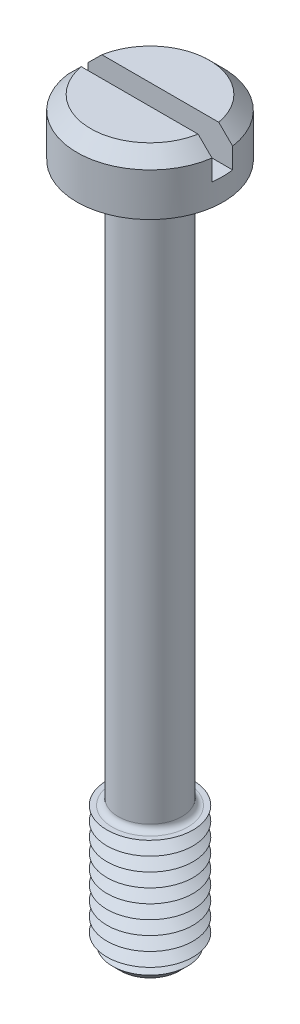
ISO-10303-21;
HEADER;
FILE_DESCRIPTION(('STEP AP214'),'2;1');
FILE_NAME('part.step','',(''),(''),'','','');
FILE_SCHEMA(('AUTOMOTIVE_DESIGN { 1 0 10303 214 1 1 1 1 }'));
ENDSEC;
DATA;
#1=APPLICATION_CONTEXT('core data for automotive mechanical design processes');
#2=APPLICATION_PROTOCOL_DEFINITION('international standard','automotive_design',2000,#1);
#3=PRODUCT_CONTEXT('',#1,'mechanical');
#4=PRODUCT('Part','Part','',(#3));
#5=PRODUCT_RELATED_PRODUCT_CATEGORY('part','',(#4));
#6=PRODUCT_DEFINITION_FORMATION('','',#4);
#7=PRODUCT_DEFINITION_CONTEXT('part definition',#1,'design');
#8=PRODUCT_DEFINITION('design','',#6,#7);
#9=PRODUCT_DEFINITION_SHAPE('','',#8);
#10=(LENGTH_UNIT() NAMED_UNIT(*) SI_UNIT(.MILLI.,.METRE.));
#11=(NAMED_UNIT(*) PLANE_ANGLE_UNIT() SI_UNIT($,.RADIAN.));
#12=(NAMED_UNIT(*) SI_UNIT($,.STERADIAN.) SOLID_ANGLE_UNIT());
#13=UNCERTAINTY_MEASURE_WITH_UNIT(LENGTH_MEASURE(1.E-05),#10,'distance_accuracy_value','');
#14=(GEOMETRIC_REPRESENTATION_CONTEXT(3) GLOBAL_UNCERTAINTY_ASSIGNED_CONTEXT((#13)) GLOBAL_UNIT_ASSIGNED_CONTEXT((#10,
#11,#12)) REPRESENTATION_CONTEXT('',''));
#15=CARTESIAN_POINT('',(0.,0.,0.));
#16=DIRECTION('',(0.,0.,1.));
#17=DIRECTION('',(1.,0.,0.));
#18=AXIS2_PLACEMENT_3D('',#15,#16,#17);
#19=CARTESIAN_POINT('',(0.,3.3,0.));
#20=DIRECTION('',(0.,1.,0.));
#21=DIRECTION('',(0.,0.,1.));
#22=AXIS2_PLACEMENT_3D('',#19,#20,#21);
#23=PLANE('',#22);
#24=DIRECTION('',(-1.,0.,0.));
#25=VECTOR('',#24,1.);
#26=CARTESIAN_POINT('',(4.25,3.3,-0.6));
#27=LINE('',#26,#25);
#28=CARTESIAN_POINT('',(3.39742549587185,3.3,-0.6));
#29=VERTEX_POINT('',#28);
#30=CARTESIAN_POINT('',(-3.39742549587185,3.3,-0.6));
#31=VERTEX_POINT('',#30);
#32=EDGE_CURVE('E110',#29,#31,#27,.T.);
#33=ORIENTED_EDGE('',*,*,#32,.F.);
#34=CARTESIAN_POINT('',(0.,3.3,0.));
#35=DIRECTION('',(0.,1.,0.));
#36=DIRECTION('',(0.,0.,1.));
#37=AXIS2_PLACEMENT_3D('',#34,#35,#36);
#38=CIRCLE('',#37,3.45000000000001);
#39=EDGE_CURVE('E113',#29,#31,#38,.T.);
#40=ORIENTED_EDGE('',*,*,#39,.T.);
#41=EDGE_LOOP('',(#33,#40));
#42=FACE_BOUND('',#41,.T.);
#43=ADVANCED_FACE('F39',(#42),#23,.T.);
#44=CARTESIAN_POINT('',(0.,3.3,0.));
#45=DIRECTION('',(0.,-1.,0.));
#46=DIRECTION('',(0.,0.,-1.));
#47=AXIS2_PLACEMENT_3D('',#44,#45,#46);
#48=CONICAL_SURFACE('',#47,3.45000000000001,0.785398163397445);
#49=CARTESIAN_POINT('',(9.35351408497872,-2.62273843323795,-0.6));
#50=CARTESIAN_POINT('',(9.03263557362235,-2.3025231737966,-0.6));
#51=CARTESIAN_POINT('',(8.71172811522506,-1.9823369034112,-0.6));
#52=CARTESIAN_POINT('',(8.06981262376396,-1.34205341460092,-0.6));
#53=CARTESIAN_POINT('',(7.74880458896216,-1.02195619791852,-0.6));
#54=CARTESIAN_POINT('',(7.10652460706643,-0.381761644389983,-0.6));
#55=CARTESIAN_POINT('',(6.78525260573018,-0.061664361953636,-0.6));
#56=CARTESIAN_POINT('',(6.14251393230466,0.578323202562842,-0.6));
#57=CARTESIAN_POINT('',(5.82104726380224,0.89821348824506,-0.6));
#58=CARTESIAN_POINT('',(5.17196209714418,1.54347500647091,-0.6));
#59=CARTESIAN_POINT('',(4.84433778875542,1.86884039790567,-0.6));
#60=CARTESIAN_POINT('',(4.35244442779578,2.35644593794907,-0.6));
#61=CARTESIAN_POINT('',(4.18839924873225,2.51891187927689,-0.6));
#62=CARTESIAN_POINT('',(3.86009606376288,2.84362679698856,-0.6));
#63=CARTESIAN_POINT('',(3.69583805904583,3.00587577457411,-0.6));
#64=CARTESIAN_POINT('',(3.36705354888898,3.33001661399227,-0.6));
#65=CARTESIAN_POINT('',(3.20252712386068,3.49190855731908,-0.6));
#66=CARTESIAN_POINT('',(2.87298689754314,3.81520272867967,-0.6));
#67=CARTESIAN_POINT('',(2.70797308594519,3.97660494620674,-0.6));
#68=CARTESIAN_POINT('',(2.37716903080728,4.29858210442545,-0.6));
#69=CARTESIAN_POINT('',(2.21137886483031,4.45915712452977,-0.6));
#70=CARTESIAN_POINT('',(1.96157219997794,4.69884609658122,-0.6));
#71=CARTESIAN_POINT('',(1.87811785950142,4.77854546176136,-0.6));
#72=CARTESIAN_POINT('',(1.71066064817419,4.93736532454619,-0.6));
#73=CARTESIAN_POINT('',(1.62665778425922,5.01648582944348,-0.6));
#74=CARTESIAN_POINT('',(1.49655488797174,5.13773269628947,-0.6));
#75=CARTESIAN_POINT('',(1.45074972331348,5.18017521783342,-0.6));
#76=CARTESIAN_POINT('',(1.35882119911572,5.26471614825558,-0.6));
#77=CARTESIAN_POINT('',(1.31269783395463,5.30681455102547,-0.6));
#78=CARTESIAN_POINT('',(1.22008852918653,5.39050695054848,-0.6));
#79=CARTESIAN_POINT('',(1.17360305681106,5.43210146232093,-0.6));
#80=CARTESIAN_POINT('',(1.08007401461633,5.51465347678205,-0.6));
#81=CARTESIAN_POINT('',(1.0330304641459,5.55561100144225,-0.6));
#82=CARTESIAN_POINT('',(0.919047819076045,5.65299331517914,-0.6));
#83=CARTESIAN_POINT('',(0.85173842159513,5.70899242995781,-0.6));
#84=CARTESIAN_POINT('',(0.748806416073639,5.79068526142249,-0.6));
#85=CARTESIAN_POINT('',(0.714125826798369,5.81756213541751,-0.6));
#86=CARTESIAN_POINT('',(0.643915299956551,5.87018079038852,-0.6));
#87=CARTESIAN_POINT('',(0.608385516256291,5.89592277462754,-0.6));
#88=CARTESIAN_POINT('',(0.545162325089,5.93955652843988,-0.6));
#89=CARTESIAN_POINT('',(0.517718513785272,5.95780799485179,-0.6));
#90=CARTESIAN_POINT('',(0.462025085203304,5.9930317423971,-0.6));
#91=CARTESIAN_POINT('',(0.43377569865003,6.01000438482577,-0.6));
#92=CARTESIAN_POINT('',(0.376341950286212,6.04213837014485,-0.6));
#93=CARTESIAN_POINT('',(0.347160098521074,6.05730412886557,-0.6));
#94=CARTESIAN_POINT('',(0.2876425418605,6.08513394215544,-0.6));
#95=CARTESIAN_POINT('',(0.25730803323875,6.09780051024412,-0.6));
#96=CARTESIAN_POINT('',(0.190863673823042,6.12124627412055,-0.6));
#97=CARTESIAN_POINT('',(0.154554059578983,6.13148571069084,-0.6));
#98=CARTESIAN_POINT('',(0.0807909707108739,6.14565404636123,-0.6));
#99=CARTESIAN_POINT('',(0.0433423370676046,6.14960664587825,-0.6));
#100=CARTESIAN_POINT('',(-0.0317987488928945,6.15033783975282,-0.6));
#101=CARTESIAN_POINT('',(-0.0694915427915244,6.14708428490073,-0.6));
#102=CARTESIAN_POINT('',(-0.143790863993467,6.13410921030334,-0.6));
#103=CARTESIAN_POINT('',(-0.180393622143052,6.12436747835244,-0.6));
#104=CARTESIAN_POINT('',(-0.254098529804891,6.09939647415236,-0.6));
#105=CARTESIAN_POINT('',(-0.291094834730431,6.08386859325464,-0.6));
#106=CARTESIAN_POINT('',(-0.363408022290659,6.04924663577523,-0.6));
#107=CARTESIAN_POINT('',(-0.398721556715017,6.03014579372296,-0.6));
#108=CARTESIAN_POINT('',(-0.468234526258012,5.98944452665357,-0.6));
#109=CARTESIAN_POINT('',(-0.502422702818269,5.96782521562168,-0.6));
#110=CARTESIAN_POINT('',(-0.569689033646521,5.9230061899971,-0.6));
#111=CARTESIAN_POINT('',(-0.602768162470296,5.89980792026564,-0.6));
#112=CARTESIAN_POINT('',(-0.671148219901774,5.85008963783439,-0.6));
#113=CARTESIAN_POINT('',(-0.706369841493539,5.82346130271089,-0.6));
#114=CARTESIAN_POINT('',(-0.776087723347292,5.76926828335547,-0.6));
#115=CARTESIAN_POINT('',(-0.810583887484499,5.74170347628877,-0.6));
#116=CARTESIAN_POINT('',(-0.913286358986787,5.65798278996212,-0.6));
#117=CARTESIAN_POINT('',(-0.980673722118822,5.60082541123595,-0.6));
#118=CARTESIAN_POINT('',(-1.11424616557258,5.48490670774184,-0.6));
#119=CARTESIAN_POINT('',(-1.18042891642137,5.42614273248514,-0.6));
#120=CARTESIAN_POINT('',(-1.31191262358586,5.30767463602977,-0.6));
#121=CARTESIAN_POINT('',(-1.37721382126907,5.24797078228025,-0.6));
#122=CARTESIAN_POINT('',(-1.50701089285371,5.12812906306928,-0.6));
#123=CARTESIAN_POINT('',(-1.57150872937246,5.06799331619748,-0.6));
#124=CARTESIAN_POINT('',(-1.7000913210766,4.94727328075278,-0.6));
#125=CARTESIAN_POINT('',(-1.76417604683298,4.88668896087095,-0.6));
#126=CARTESIAN_POINT('',(-1.95584105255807,4.7045882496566,-0.6));
#127=CARTESIAN_POINT('',(-2.08296922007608,4.58259645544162,-0.6));
#128=CARTESIAN_POINT('',(-2.33599178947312,4.33840625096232,-0.6));
#129=CARTESIAN_POINT('',(-2.4618891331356,4.21621087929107,-0.6));
#130=CARTESIAN_POINT('',(-2.71323511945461,3.97135925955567,-0.6));
#131=CARTESIAN_POINT('',(-2.8386837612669,3.84870301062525,-0.6));
#132=CARTESIAN_POINT('',(-3.21459106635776,3.48027743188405,-0.6));
#133=CARTESIAN_POINT('',(-3.46460626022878,3.23405597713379,-0.6));
#134=CARTESIAN_POINT('',(-3.96413793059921,2.74090313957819,-0.6));
#135=CARTESIAN_POINT('',(-4.21365415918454,2.49397150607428,-0.6));
#136=CARTESIAN_POINT('',(-4.71232475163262,1.99974737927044,-0.6));
#137=CARTESIAN_POINT('',(-4.96147911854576,1.75245488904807,-0.6));
#138=CARTESIAN_POINT('',(-5.45958725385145,1.25761544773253,-0.6));
#139=CARTESIAN_POINT('',(-5.70854099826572,1.01006847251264,-0.6));
#140=CARTESIAN_POINT('',(-6.20629498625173,0.514819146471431,-0.6));
#141=CARTESIAN_POINT('',(-6.45509522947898,0.267116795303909,-0.6));
#142=CARTESIAN_POINT('',(-7.20128563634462,-0.476100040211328,-0.6));
#143=CARTESIAN_POINT('',(-7.69851620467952,-0.971774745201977,-0.6));
#144=CARTESIAN_POINT('',(-8.38865115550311,-1.66007026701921,-0.6));
#145=CARTESIAN_POINT('',(-8.58165346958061,-1.85259293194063,-0.6));
#146=CARTESIAN_POINT('',(-8.87112736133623,-2.14139225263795,-0.6));
#147=CARTESIAN_POINT('',(-8.96761014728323,-2.23765767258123,-0.6));
#148=CARTESIAN_POINT('',(-9.16056764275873,-2.43019387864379,-0.6));
#149=CARTESIAN_POINT('',(-9.25704235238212,-2.52646466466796,-0.6));
#150=CARTESIAN_POINT('',(-9.35351408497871,-2.62273843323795,-0.6));
#151=B_SPLINE_CURVE_WITH_KNOTS('',3,(#49,#50,#51,#52,#53,#54,#55,#56,#57,#58,#59,#60,#61,#62,
#63,#64,#65,#66,#67,#68,#69,#70,#71,#72,#73,#74,#75,#76,#77,#78,#79,#80,#81,#82,#83,#84,#85,#86,
#87,#88,#89,#90,#91,#92,#93,#94,#95,#96,#97,#98,#99,#100,#101,#102,#103,#104,#105,#106,#107,
#108,#109,#110,#111,#112,#113,#114,#115,#116,#117,#118,#119,#120,#121,#122,#123,#124,#125,#126,
#127,#128,#129,#130,#131,#132,#133,#134,#135,#136,#137,#138,#139,#140,#141,#142,#143,#144,#145,
#146,#147,#148,#149,#150),.UNSPECIFIED.,.F.,.F.,(4,2,2,2,2,2,2,2,2,2,2,2,2,2,2,2,2,2,2,2,2,2,2,
2,2,2,2,2,2,2,2,2,2,2,2,2,2,2,2,2,2,2,2,2,2,2,2,2,2,2,4),(0.,1.35996600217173,2.71995696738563,
4.08050889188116,5.44103646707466,6.82624457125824,7.51888721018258,8.21152599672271,
8.90398568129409,9.59646011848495,10.288866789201,10.635058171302,10.9812451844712,
11.1685812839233,11.355920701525,11.5430489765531,11.7301707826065,11.9927784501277,
12.1243921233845,12.2559821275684,12.3548333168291,12.4536564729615,12.5522329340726,
12.6507097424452,12.7634617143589,12.8757876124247,12.9886156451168,13.1017968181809,
13.2218851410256,13.3422031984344,13.4634899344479,13.584667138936,13.7171086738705,
13.8495676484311,14.1146090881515,14.3801178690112,14.6455524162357,14.910099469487,
15.17466516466,15.7032346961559,16.2295761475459,16.7559185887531,17.8086237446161,
18.8617626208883,19.9148925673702,20.9681337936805,22.0213773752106,24.1276499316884,
24.9454725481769,25.3543534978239,25.7632286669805),.UNSPECIFIED.);
#152=CARTESIAN_POINT('',(4.20743389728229,2.5,-0.6));
#153=VERTEX_POINT('',#152);
#154=EDGE_CURVE('E268',#153,#29,#151,.T.);
#155=ORIENTED_EDGE('',*,*,#154,.F.);
#156=CARTESIAN_POINT('',(0.,2.5,0.));
#157=DIRECTION('',(0.,1.,0.));
#158=DIRECTION('',(0.,0.,1.));
#159=AXIS2_PLACEMENT_3D('',#156,#157,#158);
#160=CIRCLE('',#159,4.25);
#161=CARTESIAN_POINT('',(-4.20743389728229,2.5,-0.6));
#162=VERTEX_POINT('',#161);
#163=EDGE_CURVE('E128',#162,#153,#160,.F.);
#164=ORIENTED_EDGE('',*,*,#163,.F.);
#165=EDGE_CURVE('E102',#31,#162,#151,.T.);
#166=ORIENTED_EDGE('',*,*,#165,.F.);
#167=ORIENTED_EDGE('',*,*,#39,.F.);
#168=EDGE_LOOP('',(#155,#164,#166,#167));
#169=FACE_BOUND('',#168,.T.);
#170=ADVANCED_FACE('F230',(#169),#48,.T.);
#171=CARTESIAN_POINT('',(0.,-40.,0.));
#172=DIRECTION('',(0.,1.,0.));
#173=DIRECTION('',(0.,0.,1.));
#174=AXIS2_PLACEMENT_3D('',#171,#172,#173);
#175=CYLINDRICAL_SURFACE('',#174,1.85);
#176=CARTESIAN_POINT('',(0.,-32.15,0.));
#177=DIRECTION('',(0.,-1.,0.));
#178=DIRECTION('',(0.,0.,-1.));
#179=AXIS2_PLACEMENT_3D('',#176,#177,#178);
#180=CIRCLE('',#179,1.85);
#181=CARTESIAN_POINT('',(0.,-32.15,-1.85));
#182=VERTEX_POINT('',#181);
#183=EDGE_CURVE('E123',#182,#182,#180,.F.);
#184=ORIENTED_EDGE('',*,*,#183,.T.);
#185=EDGE_LOOP('',(#184));
#186=FACE_BOUND('',#185,.T.);
#187=CARTESIAN_POINT('',(0.,-0.350000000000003,0.));
#188=DIRECTION('',(0.,1.,0.));
#189=DIRECTION('',(0.,0.,1.));
#190=AXIS2_PLACEMENT_3D('',#187,#188,#189);
#191=CIRCLE('',#190,1.85);
#192=CARTESIAN_POINT('',(0.,-0.350000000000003,1.85));
#193=VERTEX_POINT('',#192);
#194=EDGE_CURVE('E383',#193,#193,#191,.F.);
#195=ORIENTED_EDGE('',*,*,#194,.T.);
#196=EDGE_LOOP('',(#195));
#197=FACE_BOUND('',#196,.T.);
#198=ADVANCED_FACE('F226',(#186,#197),#175,.T.);
#199=CARTESIAN_POINT('',(0.,3.3,0.));
#200=DIRECTION('',(0.,-1.,0.));
#201=DIRECTION('',(0.,0.,-1.));
#202=AXIS2_PLACEMENT_3D('',#199,#200,#201);
#203=CYLINDRICAL_SURFACE('',#202,4.25);
#204=ORIENTED_EDGE('',*,*,#163,.T.);
#205=DIRECTION('',(0.,-1.,0.));
#206=VECTOR('',#205,1.);
#207=CARTESIAN_POINT('',(4.20743389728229,3.3,-0.6));
#208=LINE('',#207,#206);
#209=CARTESIAN_POINT('',(4.20743389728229,1.3,-0.6));
#210=VERTEX_POINT('',#209);
#211=EDGE_CURVE('E64',#153,#210,#208,.T.);
#212=ORIENTED_EDGE('',*,*,#211,.T.);
#213=CARTESIAN_POINT('',(0.,1.3,0.));
#214=DIRECTION('',(0.,1.,0.));
#215=DIRECTION('',(0.,0.,1.));
#216=AXIS2_PLACEMENT_3D('',#213,#214,#215);
#217=CIRCLE('',#216,4.25);
#218=CARTESIAN_POINT('',(4.20743389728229,1.3,0.6));
#219=VERTEX_POINT('',#218);
#220=EDGE_CURVE('E11',#219,#210,#217,.T.);
#221=ORIENTED_EDGE('',*,*,#220,.F.);
#222=DIRECTION('',(0.,-1.,0.));
#223=VECTOR('',#222,1.);
#224=CARTESIAN_POINT('',(4.20743389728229,3.3,0.6));
#225=LINE('',#224,#223);
#226=CARTESIAN_POINT('',(4.20743389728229,2.5,0.6));
#227=VERTEX_POINT('',#226);
#228=EDGE_CURVE('E285',#219,#227,#225,.F.);
#229=ORIENTED_EDGE('',*,*,#228,.T.);
#230=CARTESIAN_POINT('',(-4.20743389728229,2.5,0.6));
#231=VERTEX_POINT('',#230);
#232=EDGE_CURVE('E120',#227,#231,#160,.F.);
#233=ORIENTED_EDGE('',*,*,#232,.T.);
#234=DIRECTION('',(0.,-1.,0.));
#235=VECTOR('',#234,1.);
#236=CARTESIAN_POINT('',(-4.20743389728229,3.3,0.6));
#237=LINE('',#236,#235);
#238=CARTESIAN_POINT('',(-4.20743389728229,1.3,0.6));
#239=VERTEX_POINT('',#238);
#240=EDGE_CURVE('E96',#231,#239,#237,.T.);
#241=ORIENTED_EDGE('',*,*,#240,.T.);
#242=CARTESIAN_POINT('',(-4.20743389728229,1.3,-0.6));
#243=VERTEX_POINT('',#242);
#244=EDGE_CURVE('E44',#243,#239,#217,.T.);
#245=ORIENTED_EDGE('',*,*,#244,.F.);
#246=DIRECTION('',(0.,-1.,0.));
#247=VECTOR('',#246,1.);
#248=CARTESIAN_POINT('',(-4.20743389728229,3.3,-0.6));
#249=LINE('',#248,#247);
#250=EDGE_CURVE('E289',#243,#162,#249,.F.);
#251=ORIENTED_EDGE('',*,*,#250,.T.);
#252=EDGE_LOOP('',(#204,#212,#221,#229,#233,#241,#245,#251));
#253=FACE_BOUND('',#252,.T.);
#254=CARTESIAN_POINT('',(0.,0.,0.));
#255=DIRECTION('',(0.,1.,0.));
#256=DIRECTION('',(0.,0.,1.));
#257=AXIS2_PLACEMENT_3D('',#254,#255,#256);
#258=CIRCLE('',#257,4.25);
#259=CARTESIAN_POINT('',(0.,0.,4.25));
#260=VERTEX_POINT('',#259);
#261=EDGE_CURVE('E369',#260,#260,#258,.T.);
#262=ORIENTED_EDGE('',*,*,#261,.T.);
#263=EDGE_LOOP('',(#262));
#264=FACE_BOUND('',#263,.T.);
#265=ADVANCED_FACE('F229',(#253,#264),#203,.T.);
#266=DIRECTION('',(1.,0.,0.));
#267=VECTOR('',#266,1.);
#268=CARTESIAN_POINT('',(4.25,3.3,0.6));
#269=LINE('',#268,#267);
#270=CARTESIAN_POINT('',(-3.39742549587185,3.3,0.6));
#271=VERTEX_POINT('',#270);
#272=CARTESIAN_POINT('',(3.39742549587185,3.3,0.6));
#273=VERTEX_POINT('',#272);
#274=EDGE_CURVE('E56',#271,#273,#269,.T.);
#275=ORIENTED_EDGE('',*,*,#274,.F.);
#276=EDGE_CURVE('E108',#271,#273,#38,.T.);
#277=ORIENTED_EDGE('',*,*,#276,.T.);
#278=EDGE_LOOP('',(#275,#277));
#279=FACE_BOUND('',#278,.T.);
#280=ADVANCED_FACE('F107',(#279),#23,.T.);
#281=CARTESIAN_POINT('',(0.,0.,0.));
#282=DIRECTION('',(0.,1.,0.));
#283=DIRECTION('',(0.,0.,1.));
#284=AXIS2_PLACEMENT_3D('',#281,#282,#283);
#285=PLANE('',#284);
#286=CARTESIAN_POINT('',(0.,0.,0.));
#287=DIRECTION('',(0.,1.,0.));
#288=DIRECTION('',(0.,0.,1.));
#289=AXIS2_PLACEMENT_3D('',#286,#287,#288);
#290=CIRCLE('',#289,2.2);
#291=CARTESIAN_POINT('',(0.,0.,2.2));
#292=VERTEX_POINT('',#291);
#293=EDGE_CURVE('E114',#292,#292,#290,.T.);
#294=ORIENTED_EDGE('',*,*,#293,.T.);
#295=EDGE_LOOP('',(#294));
#296=FACE_BOUND('',#295,.T.);
#297=ORIENTED_EDGE('',*,*,#261,.F.);
#298=EDGE_LOOP('',(#297));
#299=FACE_BOUND('',#298,.T.);
#300=ADVANCED_FACE('F220',(#296,#299),#285,.F.);
#301=CARTESIAN_POINT('',(0.,-32.5,0.));
#302=DIRECTION('',(0.,-1.,0.));
#303=DIRECTION('',(0.,0.,-1.));
#304=AXIS2_PLACEMENT_3D('',#301,#302,#303);
#305=PLANE('',#304);
#306=CARTESIAN_POINT('',(0.,-32.5,0.));
#307=DIRECTION('',(0.,-1.,0.));
#308=DIRECTION('',(0.,0.,-1.));
#309=AXIS2_PLACEMENT_3D('',#306,#307,#308);
#310=CIRCLE('',#309,2.2);
#311=CARTESIAN_POINT('',(0.,-32.5,-2.2));
#312=VERTEX_POINT('',#311);
#313=EDGE_CURVE('E376',#312,#312,#310,.T.);
#314=ORIENTED_EDGE('',*,*,#313,.T.);
#315=EDGE_LOOP('',(#314));
#316=FACE_BOUND('',#315,.T.);
#317=CARTESIAN_POINT('',(0.,-32.5,0.));
#318=DIRECTION('',(0.,1.,0.));
#319=DIRECTION('',(0.,0.,1.));
#320=AXIS2_PLACEMENT_3D('',#317,#318,#319);
#321=CIRCLE('',#320,2.5);
#322=CARTESIAN_POINT('',(0.,-32.5,2.5));
#323=VERTEX_POINT('',#322);
#324=EDGE_CURVE('E365',#323,#323,#321,.T.);
#325=ORIENTED_EDGE('',*,*,#324,.T.);
#326=EDGE_LOOP('',(#325));
#327=FACE_BOUND('',#326,.T.);
#328=ADVANCED_FACE('F216',(#316,#327),#305,.F.);
#329=CARTESIAN_POINT('',(0.,-32.9,0.));
#330=DIRECTION('',(0.,1.,0.));
#331=DIRECTION('',(0.,0.,1.));
#332=AXIS2_PLACEMENT_3D('',#329,#330,#331);
#333=CONICAL_SURFACE('',#332,1.80717967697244,1.04719755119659);
#334=ORIENTED_EDGE('',*,*,#324,.F.);
#335=EDGE_LOOP('',(#334));
#336=FACE_BOUND('',#335,.T.);
#337=CARTESIAN_POINT('',(0.,-32.9,0.));
#338=DIRECTION('',(0.,1.,0.));
#339=DIRECTION('',(0.,0.,1.));
#340=AXIS2_PLACEMENT_3D('',#337,#338,#339);
#341=CIRCLE('',#340,1.80717967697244);
#342=CARTESIAN_POINT('',(0.,-32.9,1.80717967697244));
#343=VERTEX_POINT('',#342);
#344=EDGE_CURVE('E361',#343,#343,#341,.T.);
#345=ORIENTED_EDGE('',*,*,#344,.T.);
#346=EDGE_LOOP('',(#345));
#347=FACE_BOUND('',#346,.T.);
#348=ADVANCED_FACE('F212',(#336,#347),#333,.T.);
#349=CARTESIAN_POINT('',(0.,-33.3,0.));
#350=DIRECTION('',(0.,-1.,0.));
#351=DIRECTION('',(0.,0.,-1.));
#352=AXIS2_PLACEMENT_3D('',#349,#350,#351);
#353=CONICAL_SURFACE('',#352,2.5,1.04719755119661);
#354=ORIENTED_EDGE('',*,*,#344,.F.);
#355=EDGE_LOOP('',(#354));
#356=FACE_BOUND('',#355,.T.);
#357=CARTESIAN_POINT('',(0.,-33.3,0.));
#358=DIRECTION('',(0.,1.,0.));
#359=DIRECTION('',(0.,0.,1.));
#360=AXIS2_PLACEMENT_3D('',#357,#358,#359);
#361=CIRCLE('',#360,2.5);
#362=CARTESIAN_POINT('',(0.,-33.3,2.5));
#363=VERTEX_POINT('',#362);
#364=EDGE_CURVE('E358',#363,#363,#361,.T.);
#365=ORIENTED_EDGE('',*,*,#364,.T.);
#366=EDGE_LOOP('',(#365));
#367=FACE_BOUND('',#366,.T.);
#368=ADVANCED_FACE('F208',(#356,#367),#353,.T.);
#369=CARTESIAN_POINT('',(0.,-33.7,0.));
#370=DIRECTION('',(0.,1.,0.));
#371=DIRECTION('',(0.,0.,1.));
#372=AXIS2_PLACEMENT_3D('',#369,#370,#371);
#373=CONICAL_SURFACE('',#372,1.80717967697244,1.04719755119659);
#374=ORIENTED_EDGE('',*,*,#364,.F.);
#375=EDGE_LOOP('',(#374));
#376=FACE_BOUND('',#375,.T.);
#377=CARTESIAN_POINT('',(0.,-33.7,0.));
#378=DIRECTION('',(0.,1.,0.));
#379=DIRECTION('',(0.,0.,1.));
#380=AXIS2_PLACEMENT_3D('',#377,#378,#379);
#381=CIRCLE('',#380,1.80717967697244);
#382=CARTESIAN_POINT('',(0.,-33.7,1.80717967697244));
#383=VERTEX_POINT('',#382);
#384=EDGE_CURVE('E354',#383,#383,#381,.T.);
#385=ORIENTED_EDGE('',*,*,#384,.T.);
#386=EDGE_LOOP('',(#385));
#387=FACE_BOUND('',#386,.T.);
#388=ADVANCED_FACE('F204',(#376,#387),#373,.T.);
#389=CARTESIAN_POINT('',(0.,-34.1,0.));
#390=DIRECTION('',(0.,-1.,0.));
#391=DIRECTION('',(0.,0.,-1.));
#392=AXIS2_PLACEMENT_3D('',#389,#390,#391);
#393=CONICAL_SURFACE('',#392,2.5,1.04719755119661);
#394=ORIENTED_EDGE('',*,*,#384,.F.);
#395=EDGE_LOOP('',(#394));
#396=FACE_BOUND('',#395,.T.);
#397=CARTESIAN_POINT('',(0.,-34.1,0.));
#398=DIRECTION('',(0.,1.,0.));
#399=DIRECTION('',(0.,0.,1.));
#400=AXIS2_PLACEMENT_3D('',#397,#398,#399);
#401=CIRCLE('',#400,2.5);
#402=CARTESIAN_POINT('',(0.,-34.1,2.5));
#403=VERTEX_POINT('',#402);
#404=EDGE_CURVE('E350',#403,#403,#401,.T.);
#405=ORIENTED_EDGE('',*,*,#404,.T.);
#406=EDGE_LOOP('',(#405));
#407=FACE_BOUND('',#406,.T.);
#408=ADVANCED_FACE('F200',(#396,#407),#393,.T.);
#409=CARTESIAN_POINT('',(0.,-34.5,0.));
#410=DIRECTION('',(0.,1.,0.));
#411=DIRECTION('',(0.,0.,1.));
#412=AXIS2_PLACEMENT_3D('',#409,#410,#411);
#413=CONICAL_SURFACE('',#412,1.80717967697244,1.04719755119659);
#414=ORIENTED_EDGE('',*,*,#404,.F.);
#415=EDGE_LOOP('',(#414));
#416=FACE_BOUND('',#415,.T.);
#417=CARTESIAN_POINT('',(0.,-34.5,0.));
#418=DIRECTION('',(0.,1.,0.));
#419=DIRECTION('',(0.,0.,1.));
#420=AXIS2_PLACEMENT_3D('',#417,#418,#419);
#421=CIRCLE('',#420,1.80717967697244);
#422=CARTESIAN_POINT('',(0.,-34.5,1.80717967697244));
#423=VERTEX_POINT('',#422);
#424=EDGE_CURVE('E346',#423,#423,#421,.T.);
#425=ORIENTED_EDGE('',*,*,#424,.T.);
#426=EDGE_LOOP('',(#425));
#427=FACE_BOUND('',#426,.T.);
#428=ADVANCED_FACE('F196',(#416,#427),#413,.T.);
#429=CARTESIAN_POINT('',(0.,-34.9,0.));
#430=DIRECTION('',(0.,-1.,0.));
#431=DIRECTION('',(0.,0.,-1.));
#432=AXIS2_PLACEMENT_3D('',#429,#430,#431);
#433=CONICAL_SURFACE('',#432,2.5,1.04719755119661);
#434=ORIENTED_EDGE('',*,*,#424,.F.);
#435=EDGE_LOOP('',(#434));
#436=FACE_BOUND('',#435,.T.);
#437=CARTESIAN_POINT('',(0.,-34.9,0.));
#438=DIRECTION('',(0.,1.,0.));
#439=DIRECTION('',(0.,0.,1.));
#440=AXIS2_PLACEMENT_3D('',#437,#438,#439);
#441=CIRCLE('',#440,2.5);
#442=CARTESIAN_POINT('',(0.,-34.9,2.5));
#443=VERTEX_POINT('',#442);
#444=EDGE_CURVE('E342',#443,#443,#441,.T.);
#445=ORIENTED_EDGE('',*,*,#444,.T.);
#446=EDGE_LOOP('',(#445));
#447=FACE_BOUND('',#446,.T.);
#448=ADVANCED_FACE('F192',(#436,#447),#433,.T.);
#449=CARTESIAN_POINT('',(0.,-35.3,0.));
#450=DIRECTION('',(0.,1.,0.));
#451=DIRECTION('',(0.,0.,1.));
#452=AXIS2_PLACEMENT_3D('',#449,#450,#451);
#453=CONICAL_SURFACE('',#452,1.80717967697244,1.04719755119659);
#454=ORIENTED_EDGE('',*,*,#444,.F.);
#455=EDGE_LOOP('',(#454));
#456=FACE_BOUND('',#455,.T.);
#457=CARTESIAN_POINT('',(0.,-35.3,0.));
#458=DIRECTION('',(0.,1.,0.));
#459=DIRECTION('',(0.,0.,1.));
#460=AXIS2_PLACEMENT_3D('',#457,#458,#459);
#461=CIRCLE('',#460,1.80717967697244);
#462=CARTESIAN_POINT('',(0.,-35.3,1.80717967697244));
#463=VERTEX_POINT('',#462);
#464=EDGE_CURVE('E338',#463,#463,#461,.T.);
#465=ORIENTED_EDGE('',*,*,#464,.T.);
#466=EDGE_LOOP('',(#465));
#467=FACE_BOUND('',#466,.T.);
#468=ADVANCED_FACE('F188',(#456,#467),#453,.T.);
#469=CARTESIAN_POINT('',(0.,-35.7,0.));
#470=DIRECTION('',(0.,-1.,0.));
#471=DIRECTION('',(0.,0.,-1.));
#472=AXIS2_PLACEMENT_3D('',#469,#470,#471);
#473=CONICAL_SURFACE('',#472,2.5,1.04719755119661);
#474=ORIENTED_EDGE('',*,*,#464,.F.);
#475=EDGE_LOOP('',(#474));
#476=FACE_BOUND('',#475,.T.);
#477=CARTESIAN_POINT('',(0.,-35.7,0.));
#478=DIRECTION('',(0.,1.,0.));
#479=DIRECTION('',(0.,0.,1.));
#480=AXIS2_PLACEMENT_3D('',#477,#478,#479);
#481=CIRCLE('',#480,2.5);
#482=CARTESIAN_POINT('',(0.,-35.7,2.5));
#483=VERTEX_POINT('',#482);
#484=EDGE_CURVE('E335',#483,#483,#481,.T.);
#485=ORIENTED_EDGE('',*,*,#484,.T.);
#486=EDGE_LOOP('',(#485));
#487=FACE_BOUND('',#486,.T.);
#488=ADVANCED_FACE('F184',(#476,#487),#473,.T.);
#489=CARTESIAN_POINT('',(0.,-36.1,0.));
#490=DIRECTION('',(0.,1.,0.));
#491=DIRECTION('',(0.,0.,1.));
#492=AXIS2_PLACEMENT_3D('',#489,#490,#491);
#493=CONICAL_SURFACE('',#492,1.80717967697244,1.04719755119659);
#494=ORIENTED_EDGE('',*,*,#484,.F.);
#495=EDGE_LOOP('',(#494));
#496=FACE_BOUND('',#495,.T.);
#497=CARTESIAN_POINT('',(0.,-36.1,0.));
#498=DIRECTION('',(0.,1.,0.));
#499=DIRECTION('',(0.,0.,1.));
#500=AXIS2_PLACEMENT_3D('',#497,#498,#499);
#501=CIRCLE('',#500,1.80717967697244);
#502=CARTESIAN_POINT('',(0.,-36.1,1.80717967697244));
#503=VERTEX_POINT('',#502);
#504=EDGE_CURVE('E331',#503,#503,#501,.T.);
#505=ORIENTED_EDGE('',*,*,#504,.T.);
#506=EDGE_LOOP('',(#505));
#507=FACE_BOUND('',#506,.T.);
#508=ADVANCED_FACE('F180',(#496,#507),#493,.T.);
#509=CARTESIAN_POINT('',(0.,-36.5,0.));
#510=DIRECTION('',(0.,-1.,0.));
#511=DIRECTION('',(0.,0.,-1.));
#512=AXIS2_PLACEMENT_3D('',#509,#510,#511);
#513=CONICAL_SURFACE('',#512,2.5,1.04719755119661);
#514=ORIENTED_EDGE('',*,*,#504,.F.);
#515=EDGE_LOOP('',(#514));
#516=FACE_BOUND('',#515,.T.);
#517=CARTESIAN_POINT('',(0.,-36.5,0.));
#518=DIRECTION('',(0.,1.,0.));
#519=DIRECTION('',(0.,0.,1.));
#520=AXIS2_PLACEMENT_3D('',#517,#518,#519);
#521=CIRCLE('',#520,2.5);
#522=CARTESIAN_POINT('',(0.,-36.5,2.5));
#523=VERTEX_POINT('',#522);
#524=EDGE_CURVE('E327',#523,#523,#521,.T.);
#525=ORIENTED_EDGE('',*,*,#524,.T.);
#526=EDGE_LOOP('',(#525));
#527=FACE_BOUND('',#526,.T.);
#528=ADVANCED_FACE('F176',(#516,#527),#513,.T.);
#529=CARTESIAN_POINT('',(0.,-36.9,0.));
#530=DIRECTION('',(0.,1.,0.));
#531=DIRECTION('',(0.,0.,1.));
#532=AXIS2_PLACEMENT_3D('',#529,#530,#531);
#533=CONICAL_SURFACE('',#532,1.80717967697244,1.04719755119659);
#534=ORIENTED_EDGE('',*,*,#524,.F.);
#535=EDGE_LOOP('',(#534));
#536=FACE_BOUND('',#535,.T.);
#537=CARTESIAN_POINT('',(0.,-36.9,0.));
#538=DIRECTION('',(0.,1.,0.));
#539=DIRECTION('',(0.,0.,1.));
#540=AXIS2_PLACEMENT_3D('',#537,#538,#539);
#541=CIRCLE('',#540,1.80717967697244);
#542=CARTESIAN_POINT('',(0.,-36.9,1.80717967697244));
#543=VERTEX_POINT('',#542);
#544=EDGE_CURVE('E324',#543,#543,#541,.T.);
#545=ORIENTED_EDGE('',*,*,#544,.T.);
#546=EDGE_LOOP('',(#545));
#547=FACE_BOUND('',#546,.T.);
#548=ADVANCED_FACE('F172',(#536,#547),#533,.T.);
#549=CARTESIAN_POINT('',(0.,-37.3,0.));
#550=DIRECTION('',(0.,-1.,0.));
#551=DIRECTION('',(0.,0.,-1.));
#552=AXIS2_PLACEMENT_3D('',#549,#550,#551);
#553=CONICAL_SURFACE('',#552,2.5,1.04719755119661);
#554=ORIENTED_EDGE('',*,*,#544,.F.);
#555=EDGE_LOOP('',(#554));
#556=FACE_BOUND('',#555,.T.);
#557=CARTESIAN_POINT('',(0.,-37.3,0.));
#558=DIRECTION('',(0.,1.,0.));
#559=DIRECTION('',(0.,0.,1.));
#560=AXIS2_PLACEMENT_3D('',#557,#558,#559);
#561=CIRCLE('',#560,2.5);
#562=CARTESIAN_POINT('',(0.,-37.3,2.5));
#563=VERTEX_POINT('',#562);
#564=EDGE_CURVE('E320',#563,#563,#561,.T.);
#565=ORIENTED_EDGE('',*,*,#564,.T.);
#566=EDGE_LOOP('',(#565));
#567=FACE_BOUND('',#566,.T.);
#568=ADVANCED_FACE('F168',(#556,#567),#553,.T.);
#569=CARTESIAN_POINT('',(0.,-37.7,0.));
#570=DIRECTION('',(0.,1.,0.));
#571=DIRECTION('',(0.,0.,1.));
#572=AXIS2_PLACEMENT_3D('',#569,#570,#571);
#573=CONICAL_SURFACE('',#572,1.80717967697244,1.04719755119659);
#574=ORIENTED_EDGE('',*,*,#564,.F.);
#575=EDGE_LOOP('',(#574));
#576=FACE_BOUND('',#575,.T.);
#577=CARTESIAN_POINT('',(0.,-37.7,0.));
#578=DIRECTION('',(0.,1.,0.));
#579=DIRECTION('',(0.,0.,1.));
#580=AXIS2_PLACEMENT_3D('',#577,#578,#579);
#581=CIRCLE('',#580,1.80717967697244);
#582=CARTESIAN_POINT('',(0.,-37.7,1.80717967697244));
#583=VERTEX_POINT('',#582);
#584=EDGE_CURVE('E317',#583,#583,#581,.T.);
#585=ORIENTED_EDGE('',*,*,#584,.T.);
#586=EDGE_LOOP('',(#585));
#587=FACE_BOUND('',#586,.T.);
#588=ADVANCED_FACE('F164',(#576,#587),#573,.T.);
#589=CARTESIAN_POINT('',(0.,-38.1,0.));
#590=DIRECTION('',(0.,-1.,0.));
#591=DIRECTION('',(0.,0.,-1.));
#592=AXIS2_PLACEMENT_3D('',#589,#590,#591);
#593=CONICAL_SURFACE('',#592,2.5,1.04719755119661);
#594=ORIENTED_EDGE('',*,*,#584,.F.);
#595=EDGE_LOOP('',(#594));
#596=FACE_BOUND('',#595,.T.);
#597=CARTESIAN_POINT('',(0.,-38.1,0.));
#598=DIRECTION('',(0.,1.,0.));
#599=DIRECTION('',(0.,0.,1.));
#600=AXIS2_PLACEMENT_3D('',#597,#598,#599);
#601=CIRCLE('',#600,2.5);
#602=CARTESIAN_POINT('',(0.,-38.1,2.5));
#603=VERTEX_POINT('',#602);
#604=EDGE_CURVE('E313',#603,#603,#601,.T.);
#605=ORIENTED_EDGE('',*,*,#604,.T.);
#606=EDGE_LOOP('',(#605));
#607=FACE_BOUND('',#606,.T.);
#608=ADVANCED_FACE('F160',(#596,#607),#593,.T.);
#609=CARTESIAN_POINT('',(0.,-38.5,0.));
#610=DIRECTION('',(0.,1.,0.));
#611=DIRECTION('',(0.,0.,1.));
#612=AXIS2_PLACEMENT_3D('',#609,#610,#611);
#613=CONICAL_SURFACE('',#612,1.80717967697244,1.04719755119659);
#614=ORIENTED_EDGE('',*,*,#604,.F.);
#615=EDGE_LOOP('',(#614));
#616=FACE_BOUND('',#615,.T.);
#617=CARTESIAN_POINT('',(0.,-38.5,0.));
#618=DIRECTION('',(0.,1.,0.));
#619=DIRECTION('',(0.,0.,1.));
#620=AXIS2_PLACEMENT_3D('',#617,#618,#619);
#621=CIRCLE('',#620,1.80717967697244);
#622=CARTESIAN_POINT('',(0.,-38.5,1.80717967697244));
#623=VERTEX_POINT('',#622);
#624=EDGE_CURVE('E309',#623,#623,#621,.T.);
#625=ORIENTED_EDGE('',*,*,#624,.T.);
#626=EDGE_LOOP('',(#625));
#627=FACE_BOUND('',#626,.T.);
#628=ADVANCED_FACE('F156',(#616,#627),#613,.T.);
#629=CARTESIAN_POINT('',(0.,-38.9,0.));
#630=DIRECTION('',(0.,-1.,0.));
#631=DIRECTION('',(0.,0.,-1.));
#632=AXIS2_PLACEMENT_3D('',#629,#630,#631);
#633=CONICAL_SURFACE('',#632,2.5,1.04719755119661);
#634=ORIENTED_EDGE('',*,*,#624,.F.);
#635=EDGE_LOOP('',(#634));
#636=FACE_BOUND('',#635,.T.);
#637=CARTESIAN_POINT('',(0.,-38.9,0.));
#638=DIRECTION('',(0.,1.,0.));
#639=DIRECTION('',(0.,0.,1.));
#640=AXIS2_PLACEMENT_3D('',#637,#638,#639);
#641=CIRCLE('',#640,2.5);
#642=CARTESIAN_POINT('',(0.,-38.9,2.5));
#643=VERTEX_POINT('',#642);
#644=EDGE_CURVE('E304',#643,#643,#641,.T.);
#645=ORIENTED_EDGE('',*,*,#644,.T.);
#646=EDGE_LOOP('',(#645));
#647=FACE_BOUND('',#646,.T.);
#648=ADVANCED_FACE('F152',(#636,#647),#633,.T.);
#649=CARTESIAN_POINT('',(0.,-39.3,0.));
#650=DIRECTION('',(0.,1.,0.));
#651=DIRECTION('',(0.,0.,1.));
#652=AXIS2_PLACEMENT_3D('',#649,#650,#651);
#653=CONICAL_SURFACE('',#652,1.80717967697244,1.04719755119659);
#654=ORIENTED_EDGE('',*,*,#644,.F.);
#655=EDGE_LOOP('',(#654));
#656=FACE_BOUND('',#655,.T.);
#657=CARTESIAN_POINT('',(0.,-39.3,0.));
#658=DIRECTION('',(0.,1.,0.));
#659=DIRECTION('',(0.,0.,1.));
#660=AXIS2_PLACEMENT_3D('',#657,#658,#659);
#661=CIRCLE('',#660,1.80717967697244);
#662=CARTESIAN_POINT('',(0.,-39.3,1.80717967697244));
#663=VERTEX_POINT('',#662);
#664=EDGE_CURVE('E300',#663,#663,#661,.T.);
#665=ORIENTED_EDGE('',*,*,#664,.T.);
#666=EDGE_LOOP('',(#665));
#667=FACE_BOUND('',#666,.T.);
#668=ADVANCED_FACE('F148',(#656,#667),#653,.T.);
#669=CARTESIAN_POINT('',(0.,-39.7,0.));
#670=DIRECTION('',(0.,-1.,0.));
#671=DIRECTION('',(0.,0.,-1.));
#672=AXIS2_PLACEMENT_3D('',#669,#670,#671);
#673=CONICAL_SURFACE('',#672,2.5,1.04719755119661);
#674=CARTESIAN_POINT('',(0.,-39.5169872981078,0.));
#675=DIRECTION('',(0.,-1.,0.));
#676=DIRECTION('',(0.,0.,-1.));
#677=AXIS2_PLACEMENT_3D('',#674,#675,#676);
#678=CIRCLE('',#677,2.18301270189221);
#679=CARTESIAN_POINT('',(0.,-39.5169872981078,-2.18301270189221));
#680=VERTEX_POINT('',#679);
#681=EDGE_CURVE('E308',#680,#680,#678,.F.);
#682=ORIENTED_EDGE('',*,*,#681,.T.);
#683=EDGE_LOOP('',(#682));
#684=FACE_BOUND('',#683,.T.);
#685=ORIENTED_EDGE('',*,*,#664,.F.);
#686=EDGE_LOOP('',(#685));
#687=FACE_BOUND('',#686,.T.);
#688=ADVANCED_FACE('F144',(#684,#687),#673,.T.);
#689=CARTESIAN_POINT('',(0.,-40.,0.));
#690=DIRECTION('',(0.,-1.,0.));
#691=DIRECTION('',(0.,0.,-1.));
#692=AXIS2_PLACEMENT_3D('',#689,#690,#691);
#693=PLANE('',#692);
#694=CARTESIAN_POINT('',(0.,-40.,0.));
#695=DIRECTION('',(0.,-1.,0.));
#696=DIRECTION('',(0.,0.,-1.));
#697=AXIS2_PLACEMENT_3D('',#694,#695,#696);
#698=CIRCLE('',#697,1.7);
#699=CARTESIAN_POINT('',(0.,-40.,-1.7));
#700=VERTEX_POINT('',#699);
#701=EDGE_CURVE('E373',#700,#700,#698,.T.);
#702=ORIENTED_EDGE('',*,*,#701,.T.);
#703=EDGE_LOOP('',(#702));
#704=FACE_BOUND('',#703,.T.);
#705=ADVANCED_FACE('F147',(#704),#693,.T.);
#706=CARTESIAN_POINT('',(0.,-40.,0.));
#707=DIRECTION('',(0.,1.,0.));
#708=DIRECTION('',(0.,0.,1.));
#709=AXIS2_PLACEMENT_3D('',#706,#707,#708);
#710=CONICAL_SURFACE('',#709,1.7,0.785398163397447);
#711=ORIENTED_EDGE('',*,*,#681,.F.);
#712=EDGE_LOOP('',(#711));
#713=FACE_BOUND('',#712,.T.);
#714=ORIENTED_EDGE('',*,*,#701,.F.);
#715=EDGE_LOOP('',(#714));
#716=FACE_BOUND('',#715,.T.);
#717=ADVANCED_FACE('F224',(#713,#716),#710,.T.);
#718=CARTESIAN_POINT('',(0.,-32.15,0.));
#719=DIRECTION('',(0.,-1.,0.));
#720=DIRECTION('',(0.,0.,-1.));
#721=AXIS2_PLACEMENT_3D('',#718,#719,#720);
#722=TOROIDAL_SURFACE('',#721,2.2,0.35);
#723=ORIENTED_EDGE('',*,*,#183,.F.);
#724=EDGE_LOOP('',(#723));
#725=FACE_BOUND('',#724,.T.);
#726=ORIENTED_EDGE('',*,*,#313,.F.);
#727=EDGE_LOOP('',(#726));
#728=FACE_BOUND('',#727,.T.);
#729=ADVANCED_FACE('F242',(#725,#728),#722,.F.);
#730=CARTESIAN_POINT('',(0.,-0.350000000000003,0.));
#731=DIRECTION('',(0.,1.,0.));
#732=DIRECTION('',(0.,0.,1.));
#733=AXIS2_PLACEMENT_3D('',#730,#731,#732);
#734=TOROIDAL_SURFACE('',#733,2.2,0.35);
#735=ORIENTED_EDGE('',*,*,#293,.F.);
#736=EDGE_LOOP('',(#735));
#737=FACE_BOUND('',#736,.T.);
#738=ORIENTED_EDGE('',*,*,#194,.F.);
#739=EDGE_LOOP('',(#738));
#740=FACE_BOUND('',#739,.T.);
#741=ADVANCED_FACE('F245',(#737,#740),#734,.F.);
#742=CARTESIAN_POINT('',(-9.35351408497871,-2.62273843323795,0.6));
#743=CARTESIAN_POINT('',(-9.03263557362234,-2.3025231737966,0.6));
#744=CARTESIAN_POINT('',(-8.71172811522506,-1.9823369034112,0.6));
#745=CARTESIAN_POINT('',(-8.06981262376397,-1.34205341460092,0.6));
#746=CARTESIAN_POINT('',(-7.74880458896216,-1.02195619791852,0.6));
#747=CARTESIAN_POINT('',(-7.10652460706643,-0.381761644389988,0.6));
#748=CARTESIAN_POINT('',(-6.78525260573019,-0.0616643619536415,0.6));
#749=CARTESIAN_POINT('',(-6.14251393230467,0.578323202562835,0.6));
#750=CARTESIAN_POINT('',(-5.82104726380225,0.898213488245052,0.6));
#751=CARTESIAN_POINT('',(-5.17196209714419,1.5434750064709,0.6));
#752=CARTESIAN_POINT('',(-4.84433778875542,1.86884039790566,0.6));
#753=CARTESIAN_POINT('',(-4.35244442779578,2.35644593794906,0.6));
#754=CARTESIAN_POINT('',(-4.18839924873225,2.51891187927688,0.6));
#755=CARTESIAN_POINT('',(-3.86009606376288,2.84362679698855,0.6));
#756=CARTESIAN_POINT('',(-3.69583805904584,3.00587577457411,0.6));
#757=CARTESIAN_POINT('',(-3.36705354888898,3.33001661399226,0.6));
#758=CARTESIAN_POINT('',(-3.20252712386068,3.49190855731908,0.6));
#759=CARTESIAN_POINT('',(-2.87298689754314,3.81520272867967,0.6));
#760=CARTESIAN_POINT('',(-2.70797308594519,3.97660494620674,0.6));
#761=CARTESIAN_POINT('',(-2.37716903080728,4.29858210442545,0.6));
#762=CARTESIAN_POINT('',(-2.21137886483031,4.45915712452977,0.6));
#763=CARTESIAN_POINT('',(-1.96157219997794,4.69884609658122,0.6));
#764=CARTESIAN_POINT('',(-1.87811785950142,4.77854546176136,0.6));
#765=CARTESIAN_POINT('',(-1.71066064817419,4.93736532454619,0.6));
#766=CARTESIAN_POINT('',(-1.62665778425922,5.01648582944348,0.6));
#767=CARTESIAN_POINT('',(-1.49655488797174,5.13773269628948,0.6));
#768=CARTESIAN_POINT('',(-1.45074972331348,5.18017521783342,0.6));
#769=CARTESIAN_POINT('',(-1.35882119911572,5.26471614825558,0.6));
#770=CARTESIAN_POINT('',(-1.31269783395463,5.30681455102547,0.6));
#771=CARTESIAN_POINT('',(-1.22008852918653,5.39050695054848,0.6));
#772=CARTESIAN_POINT('',(-1.17360305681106,5.43210146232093,0.6));
#773=CARTESIAN_POINT('',(-1.08007401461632,5.51465347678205,0.6));
#774=CARTESIAN_POINT('',(-1.03303046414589,5.55561100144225,0.6));
#775=CARTESIAN_POINT('',(-0.919047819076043,5.65299331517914,0.6));
#776=CARTESIAN_POINT('',(-0.851738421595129,5.70899242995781,0.6));
#777=CARTESIAN_POINT('',(-0.748806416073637,5.79068526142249,0.6));
#778=CARTESIAN_POINT('',(-0.714125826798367,5.81756213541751,0.6));
#779=CARTESIAN_POINT('',(-0.643915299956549,5.87018079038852,0.6));
#780=CARTESIAN_POINT('',(-0.608385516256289,5.89592277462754,0.6));
#781=CARTESIAN_POINT('',(-0.545162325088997,5.93955652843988,0.6));
#782=CARTESIAN_POINT('',(-0.517718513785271,5.9578079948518,0.6));
#783=CARTESIAN_POINT('',(-0.462025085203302,5.9930317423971,0.6));
#784=CARTESIAN_POINT('',(-0.433775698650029,6.01000438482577,0.6));
#785=CARTESIAN_POINT('',(-0.37634195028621,6.04213837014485,0.6));
#786=CARTESIAN_POINT('',(-0.347160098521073,6.05730412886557,0.6));
#787=CARTESIAN_POINT('',(-0.2876425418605,6.08513394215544,0.6));
#788=CARTESIAN_POINT('',(-0.25730803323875,6.09780051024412,0.6));
#789=CARTESIAN_POINT('',(-0.190863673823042,6.12124627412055,0.6));
#790=CARTESIAN_POINT('',(-0.154554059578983,6.13148571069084,0.6));
#791=CARTESIAN_POINT('',(-0.0807909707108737,6.14565404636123,0.6));
#792=CARTESIAN_POINT('',(-0.043342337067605,6.14960664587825,0.6));
#793=CARTESIAN_POINT('',(0.0317987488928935,6.15033783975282,0.6));
#794=CARTESIAN_POINT('',(0.0694915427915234,6.14708428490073,0.6));
#795=CARTESIAN_POINT('',(0.143790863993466,6.13410921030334,0.6));
#796=CARTESIAN_POINT('',(0.180393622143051,6.12436747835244,0.6));
#797=CARTESIAN_POINT('',(0.25409852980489,6.09939647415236,0.6));
#798=CARTESIAN_POINT('',(0.29109483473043,6.08386859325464,0.6));
#799=CARTESIAN_POINT('',(0.363408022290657,6.04924663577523,0.6));
#800=CARTESIAN_POINT('',(0.398721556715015,6.03014579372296,0.6));
#801=CARTESIAN_POINT('',(0.46823452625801,5.98944452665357,0.6));
#802=CARTESIAN_POINT('',(0.502422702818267,5.96782521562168,0.6));
#803=CARTESIAN_POINT('',(0.569689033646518,5.92300618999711,0.6));
#804=CARTESIAN_POINT('',(0.602768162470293,5.89980792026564,0.6));
#805=CARTESIAN_POINT('',(0.671148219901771,5.8500896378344,0.6));
#806=CARTESIAN_POINT('',(0.706369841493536,5.82346130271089,0.6));
#807=CARTESIAN_POINT('',(0.776087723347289,5.76926828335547,0.6));
#808=CARTESIAN_POINT('',(0.810583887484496,5.74170347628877,0.6));
#809=CARTESIAN_POINT('',(0.913286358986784,5.65798278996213,0.6));
#810=CARTESIAN_POINT('',(0.980673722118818,5.60082541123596,0.6));
#811=CARTESIAN_POINT('',(1.11424616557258,5.48490670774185,0.6));
#812=CARTESIAN_POINT('',(1.18042891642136,5.42614273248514,0.6));
#813=CARTESIAN_POINT('',(1.31191262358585,5.30767463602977,0.6));
#814=CARTESIAN_POINT('',(1.37721382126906,5.24797078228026,0.6));
#815=CARTESIAN_POINT('',(1.5070108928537,5.12812906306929,0.6));
#816=CARTESIAN_POINT('',(1.57150872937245,5.06799331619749,0.6));
#817=CARTESIAN_POINT('',(1.70009132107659,4.94727328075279,0.6));
#818=CARTESIAN_POINT('',(1.76417604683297,4.88668896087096,0.6));
#819=CARTESIAN_POINT('',(1.95584105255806,4.70458824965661,0.6));
#820=CARTESIAN_POINT('',(2.08296922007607,4.58259645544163,0.6));
#821=CARTESIAN_POINT('',(2.33599178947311,4.33840625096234,0.6));
#822=CARTESIAN_POINT('',(2.46188913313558,4.21621087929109,0.6));
#823=CARTESIAN_POINT('',(2.71323511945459,3.97135925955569,0.6));
#824=CARTESIAN_POINT('',(2.83868376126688,3.84870301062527,0.6));
#825=CARTESIAN_POINT('',(3.21459106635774,3.48027743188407,0.6));
#826=CARTESIAN_POINT('',(3.46460626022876,3.23405597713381,0.6));
#827=CARTESIAN_POINT('',(3.96413793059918,2.74090313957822,0.6));
#828=CARTESIAN_POINT('',(4.21365415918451,2.49397150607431,0.6));
#829=CARTESIAN_POINT('',(4.71232475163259,1.99974737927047,0.6));
#830=CARTESIAN_POINT('',(4.96147911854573,1.7524548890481,0.6));
#831=CARTESIAN_POINT('',(5.45958725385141,1.25761544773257,0.6));
#832=CARTESIAN_POINT('',(5.70854099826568,1.01006847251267,0.6));
#833=CARTESIAN_POINT('',(6.20629498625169,0.51481914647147,0.6));
#834=CARTESIAN_POINT('',(6.45509522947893,0.26711679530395,0.6));
#835=CARTESIAN_POINT('',(7.20128563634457,-0.476100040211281,0.6));
#836=CARTESIAN_POINT('',(7.69851620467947,-0.971774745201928,0.6));
#837=CARTESIAN_POINT('',(8.38865115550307,-1.66007026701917,0.6));
#838=CARTESIAN_POINT('',(8.58165346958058,-1.85259293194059,0.6));
#839=CARTESIAN_POINT('',(8.87112736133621,-2.14139225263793,0.6));
#840=CARTESIAN_POINT('',(8.96761014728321,-2.23765767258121,0.6));
#841=CARTESIAN_POINT('',(9.16056764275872,-2.43019387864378,0.6));
#842=CARTESIAN_POINT('',(9.25704235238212,-2.52646466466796,0.6));
#843=CARTESIAN_POINT('',(9.35351408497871,-2.62273843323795,0.6));
#844=B_SPLINE_CURVE_WITH_KNOTS('',3,(#742,#743,#744,#745,#746,#747,#748,#749,#750,#751,#752,
#753,#754,#755,#756,#757,#758,#759,#760,#761,#762,#763,#764,#765,#766,#767,#768,#769,#770,#771,
#772,#773,#774,#775,#776,#777,#778,#779,#780,#781,#782,#783,#784,#785,#786,#787,#788,#789,#790,
#791,#792,#793,#794,#795,#796,#797,#798,#799,#800,#801,#802,#803,#804,#805,#806,#807,#808,#809,
#810,#811,#812,#813,#814,#815,#816,#817,#818,#819,#820,#821,#822,#823,#824,#825,#826,#827,#828,
#829,#830,#831,#832,#833,#834,#835,#836,#837,#838,#839,#840,#841,#842,#843),.UNSPECIFIED.,.F.,
.F.,(4,2,2,2,2,2,2,2,2,2,2,2,2,2,2,2,2,2,2,2,2,2,2,2,2,2,2,2,2,2,2,2,2,2,2,2,2,2,2,2,2,2,2,2,2,
2,2,2,2,2,4),(0.,1.35996600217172,2.71995696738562,4.08050889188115,5.44103646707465,
6.82624457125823,7.51888721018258,8.2115259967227,8.90398568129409,9.59646011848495,
10.288866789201,10.635058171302,10.9812451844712,11.1685812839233,11.355920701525,
11.5430489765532,11.7301707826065,11.9927784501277,12.1243921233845,12.2559821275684,
12.3548333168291,12.4536564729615,12.5522329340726,12.6507097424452,12.7634617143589,
12.8757876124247,12.9886156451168,13.1017968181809,13.2218851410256,13.3422031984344,
13.4634899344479,13.584667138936,13.7171086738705,13.8495676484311,14.1146090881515,
14.3801178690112,14.6455524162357,14.910099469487,15.17466516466,15.7032346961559,
16.2295761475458,16.7559185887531,17.8086237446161,18.8617626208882,19.9148925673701,
20.9681337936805,22.0213773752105,24.1276499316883,24.9454725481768,25.3543534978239,
25.7632286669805),.UNSPECIFIED.);
#845=EDGE_CURVE('E92',#231,#271,#844,.T.);
#846=ORIENTED_EDGE('',*,*,#845,.F.);
#847=ORIENTED_EDGE('',*,*,#232,.F.);
#848=EDGE_CURVE('E103',#273,#227,#844,.T.);
#849=ORIENTED_EDGE('',*,*,#848,.F.);
#850=ORIENTED_EDGE('',*,*,#276,.F.);
#851=EDGE_LOOP('',(#846,#847,#849,#850));
#852=FACE_BOUND('',#851,.T.);
#853=ADVANCED_FACE('F41',(#852),#48,.T.);
#854=CARTESIAN_POINT('',(0.,1.3,0.));
#855=DIRECTION('',(0.,1.,0.));
#856=DIRECTION('',(0.,0.,1.));
#857=AXIS2_PLACEMENT_3D('',#854,#855,#856);
#858=PLANE('',#857);
#859=DIRECTION('',(1.,0.,0.));
#860=VECTOR('',#859,1.);
#861=CARTESIAN_POINT('',(4.25,1.3,0.6));
#862=LINE('',#861,#860);
#863=EDGE_CURVE('E265',#239,#219,#862,.T.);
#864=ORIENTED_EDGE('',*,*,#863,.T.);
#865=ORIENTED_EDGE('',*,*,#220,.T.);
#866=DIRECTION('',(-1.,0.,0.));
#867=VECTOR('',#866,1.);
#868=CARTESIAN_POINT('',(4.25,1.3,-0.6));
#869=LINE('',#868,#867);
#870=EDGE_CURVE('E282',#210,#243,#869,.T.);
#871=ORIENTED_EDGE('',*,*,#870,.T.);
#872=ORIENTED_EDGE('',*,*,#244,.T.);
#873=EDGE_LOOP('',(#864,#865,#871,#872));
#874=FACE_BOUND('',#873,.T.);
#875=ADVANCED_FACE('F252',(#874),#858,.T.);
#876=CARTESIAN_POINT('',(4.25,1.3,-0.6));
#877=DIRECTION('',(0.,0.,-1.));
#878=DIRECTION('',(-1.,0.,0.));
#879=AXIS2_PLACEMENT_3D('',#876,#877,#878);
#880=PLANE('',#879);
#881=ORIENTED_EDGE('',*,*,#154,.T.);
#882=ORIENTED_EDGE('',*,*,#32,.T.);
#883=ORIENTED_EDGE('',*,*,#165,.T.);
#884=ORIENTED_EDGE('',*,*,#250,.F.);
#885=ORIENTED_EDGE('',*,*,#870,.F.);
#886=ORIENTED_EDGE('',*,*,#211,.F.);
#887=EDGE_LOOP('',(#881,#882,#883,#884,#885,#886));
#888=FACE_BOUND('',#887,.T.);
#889=ADVANCED_FACE('F141',(#888),#880,.F.);
#890=CARTESIAN_POINT('',(4.25,1.3,0.6));
#891=DIRECTION('',(0.,0.,1.));
#892=DIRECTION('',(1.,0.,0.));
#893=AXIS2_PLACEMENT_3D('',#890,#891,#892);
#894=PLANE('',#893);
#895=ORIENTED_EDGE('',*,*,#845,.T.);
#896=ORIENTED_EDGE('',*,*,#274,.T.);
#897=ORIENTED_EDGE('',*,*,#848,.T.);
#898=ORIENTED_EDGE('',*,*,#228,.F.);
#899=ORIENTED_EDGE('',*,*,#863,.F.);
#900=ORIENTED_EDGE('',*,*,#240,.F.);
#901=EDGE_LOOP('',(#895,#896,#897,#898,#899,#900));
#902=FACE_BOUND('',#901,.T.);
#903=ADVANCED_FACE('F93',(#902),#894,.F.);
#904=CLOSED_SHELL('',(#43,#170,#198,#265,#280,#300,#328,#348,#368,#388,#408,#428,#448,#468,#488,
#508,#528,#548,#568,#588,#608,#628,#648,#668,#688,#705,#717,#729,#741,#853,#875,#889,#903));
#905=MANIFOLD_SOLID_BREP('B2',#904);
#906=ADVANCED_BREP_SHAPE_REPRESENTATION('',(#18,#905),#14);
#907=SHAPE_DEFINITION_REPRESENTATION(#9,#906);
ENDSEC;
END-ISO-10303-21;
